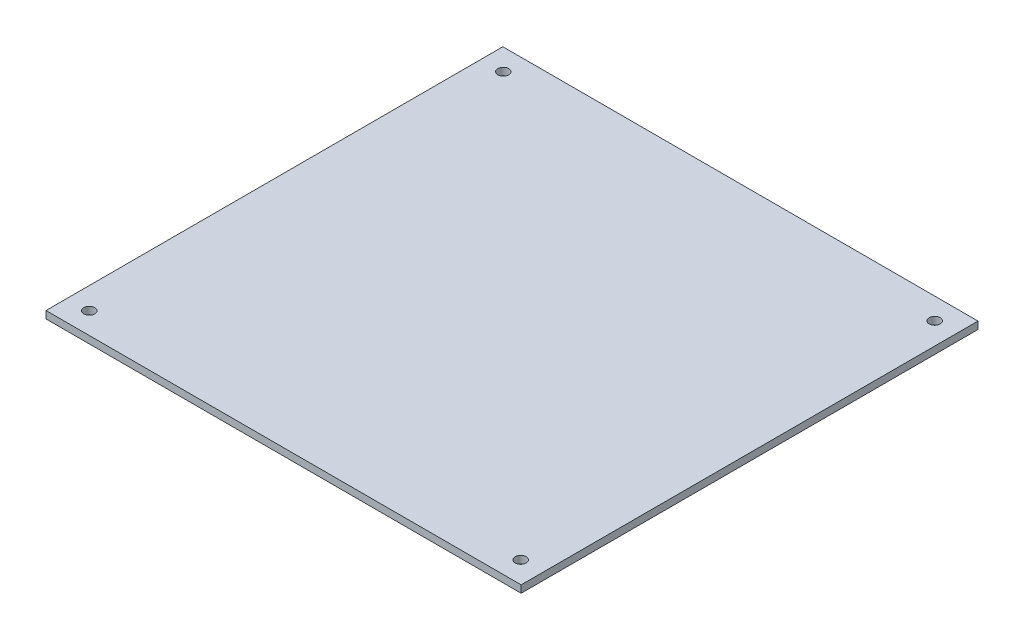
ISO-10303-21;
HEADER;
FILE_DESCRIPTION(('STEP AP214'),'2;1');
FILE_NAME('part.step','',(''),(''),'','','');
FILE_SCHEMA(('AUTOMOTIVE_DESIGN { 1 0 10303 214 1 1 1 1 }'));
ENDSEC;
DATA;
#1=APPLICATION_CONTEXT('core data for automotive mechanical design processes');
#2=APPLICATION_PROTOCOL_DEFINITION('international standard','automotive_design',2000,#1);
#3=PRODUCT_CONTEXT('',#1,'mechanical');
#4=PRODUCT('Part','Part','',(#3));
#5=PRODUCT_RELATED_PRODUCT_CATEGORY('part','',(#4));
#6=PRODUCT_DEFINITION_FORMATION('','',#4);
#7=PRODUCT_DEFINITION_CONTEXT('part definition',#1,'design');
#8=PRODUCT_DEFINITION('design','',#6,#7);
#9=PRODUCT_DEFINITION_SHAPE('','',#8);
#10=(LENGTH_UNIT() NAMED_UNIT(*) SI_UNIT(.MILLI.,.METRE.));
#11=(NAMED_UNIT(*) PLANE_ANGLE_UNIT() SI_UNIT($,.RADIAN.));
#12=(NAMED_UNIT(*) SI_UNIT($,.STERADIAN.) SOLID_ANGLE_UNIT());
#13=UNCERTAINTY_MEASURE_WITH_UNIT(LENGTH_MEASURE(1.E-05),#10,'distance_accuracy_value','');
#14=(GEOMETRIC_REPRESENTATION_CONTEXT(3) GLOBAL_UNCERTAINTY_ASSIGNED_CONTEXT((#13)) GLOBAL_UNIT_ASSIGNED_CONTEXT((#10,
#11,#12)) REPRESENTATION_CONTEXT('',''));
#15=CARTESIAN_POINT('',(0.,0.,0.));
#16=DIRECTION('',(0.,0.,1.));
#17=DIRECTION('',(1.,0.,0.));
#18=AXIS2_PLACEMENT_3D('',#15,#16,#17);
#19=CARTESIAN_POINT('',(0.,2.,0.));
#20=DIRECTION('',(0.,1.,0.));
#21=DIRECTION('',(0.,0.,1.));
#22=AXIS2_PLACEMENT_3D('',#19,#20,#21);
#23=PLANE('',#22);
#24=CARTESIAN_POINT('',(60.0235415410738,2.,-56.5120662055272));
#25=DIRECTION('',(0.,1.,0.));
#26=DIRECTION('',(0.,0.,1.));
#27=AXIS2_PLACEMENT_3D('',#24,#25,#26);
#28=CIRCLE('',#27,1.5);
#29=CARTESIAN_POINT('',(60.0235415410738,2.,-55.0120662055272));
#30=VERTEX_POINT('',#29);
#31=EDGE_CURVE('E121',#30,#30,#28,.T.);
#32=ORIENTED_EDGE('',*,*,#31,.F.);
#33=EDGE_LOOP('',(#32));
#34=FACE_BOUND('',#33,.T.);
#35=CARTESIAN_POINT('',(-58.0150782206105,2.,56.7631241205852));
#36=DIRECTION('',(0.,1.,0.));
#37=DIRECTION('',(0.,0.,1.));
#38=AXIS2_PLACEMENT_3D('',#35,#36,#37);
#39=CIRCLE('',#38,1.5);
#40=CARTESIAN_POINT('',(-58.0150782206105,2.,58.2631241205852));
#41=VERTEX_POINT('',#40);
#42=EDGE_CURVE('E100',#41,#41,#39,.T.);
#43=ORIENTED_EDGE('',*,*,#42,.F.);
#44=EDGE_LOOP('',(#43));
#45=FACE_BOUND('',#44,.T.);
#46=DIRECTION('',(1.,0.,0.));
#47=VECTOR('',#46,1.);
#48=CARTESIAN_POINT('',(-63.9957683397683,2.,62.625528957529));
#49=LINE('',#48,#47);
#50=CARTESIAN_POINT('',(-63.9957683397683,2.,62.625528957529));
#51=VERTEX_POINT('',#50);
#52=CARTESIAN_POINT('',(66.0042316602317,2.,62.625528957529));
#53=VERTEX_POINT('',#52);
#54=EDGE_CURVE('E85',#51,#53,#49,.T.);
#55=ORIENTED_EDGE('',*,*,#54,.T.);
#56=DIRECTION('',(0.,0.,-1.));
#57=VECTOR('',#56,1.);
#58=CARTESIAN_POINT('',(66.0042316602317,2.,62.625528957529));
#59=LINE('',#58,#57);
#60=CARTESIAN_POINT('',(66.0042316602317,2.,-62.374471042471));
#61=VERTEX_POINT('',#60);
#62=EDGE_CURVE('E80',#53,#61,#59,.T.);
#63=ORIENTED_EDGE('',*,*,#62,.T.);
#64=DIRECTION('',(-1.,0.,0.));
#65=VECTOR('',#64,1.);
#66=CARTESIAN_POINT('',(66.0042316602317,2.,-62.374471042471));
#67=LINE('',#66,#65);
#68=CARTESIAN_POINT('',(-63.9957683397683,2.,-62.374471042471));
#69=VERTEX_POINT('',#68);
#70=EDGE_CURVE('E83',#61,#69,#67,.T.);
#71=ORIENTED_EDGE('',*,*,#70,.T.);
#72=DIRECTION('',(0.,0.,1.));
#73=VECTOR('',#72,1.);
#74=CARTESIAN_POINT('',(-63.9957683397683,2.,-62.374471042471));
#75=LINE('',#74,#73);
#76=EDGE_CURVE('E50',#69,#51,#75,.T.);
#77=ORIENTED_EDGE('',*,*,#76,.T.);
#78=EDGE_LOOP('',(#55,#63,#71,#77));
#79=FACE_BOUND('',#78,.T.);
#80=CARTESIAN_POINT('',(60.0235415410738,2.,56.7631241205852));
#81=DIRECTION('',(0.,1.,0.));
#82=DIRECTION('',(0.,0.,1.));
#83=AXIS2_PLACEMENT_3D('',#80,#81,#82);
#84=CIRCLE('',#83,1.5);
#85=CARTESIAN_POINT('',(60.0235415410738,2.,58.2631241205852));
#86=VERTEX_POINT('',#85);
#87=EDGE_CURVE('E115',#86,#86,#84,.T.);
#88=ORIENTED_EDGE('',*,*,#87,.F.);
#89=EDGE_LOOP('',(#88));
#90=FACE_BOUND('',#89,.T.);
#91=CARTESIAN_POINT('',(-58.0150782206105,2.,-56.5120662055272));
#92=DIRECTION('',(0.,1.,0.));
#93=DIRECTION('',(0.,0.,1.));
#94=AXIS2_PLACEMENT_3D('',#91,#92,#93);
#95=CIRCLE('',#94,1.5);
#96=CARTESIAN_POINT('',(-58.0150782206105,2.,-55.0120662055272));
#97=VERTEX_POINT('',#96);
#98=EDGE_CURVE('E127',#97,#97,#95,.T.);
#99=ORIENTED_EDGE('',*,*,#98,.F.);
#100=EDGE_LOOP('',(#99));
#101=FACE_BOUND('',#100,.T.);
#102=ADVANCED_FACE('F33',(#34,#45,#79,#90,#101),#23,.T.);
#103=CARTESIAN_POINT('',(0.,0.,0.));
#104=DIRECTION('',(0.,1.,0.));
#105=DIRECTION('',(0.,0.,1.));
#106=AXIS2_PLACEMENT_3D('',#103,#104,#105);
#107=PLANE('',#106);
#108=DIRECTION('',(1.,0.,0.));
#109=VECTOR('',#108,1.);
#110=CARTESIAN_POINT('',(-63.9957683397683,0.,62.625528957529));
#111=LINE('',#110,#109);
#112=CARTESIAN_POINT('',(-63.9957683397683,0.,62.625528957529));
#113=VERTEX_POINT('',#112);
#114=CARTESIAN_POINT('',(66.0042316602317,0.,62.625528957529));
#115=VERTEX_POINT('',#114);
#116=EDGE_CURVE('E97',#113,#115,#111,.T.);
#117=ORIENTED_EDGE('',*,*,#116,.F.);
#118=DIRECTION('',(0.,0.,1.));
#119=VECTOR('',#118,1.);
#120=CARTESIAN_POINT('',(-63.9957683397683,0.,-62.374471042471));
#121=LINE('',#120,#119);
#122=CARTESIAN_POINT('',(-63.9957683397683,0.,-62.374471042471));
#123=VERTEX_POINT('',#122);
#124=EDGE_CURVE('E73',#123,#113,#121,.T.);
#125=ORIENTED_EDGE('',*,*,#124,.F.);
#126=DIRECTION('',(-1.,0.,0.));
#127=VECTOR('',#126,1.);
#128=CARTESIAN_POINT('',(66.0042316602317,0.,-62.374471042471));
#129=LINE('',#128,#127);
#130=CARTESIAN_POINT('',(66.0042316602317,0.,-62.374471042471));
#131=VERTEX_POINT('',#130);
#132=EDGE_CURVE('E67',#131,#123,#129,.T.);
#133=ORIENTED_EDGE('',*,*,#132,.F.);
#134=DIRECTION('',(0.,0.,-1.));
#135=VECTOR('',#134,1.);
#136=CARTESIAN_POINT('',(66.0042316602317,0.,62.625528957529));
#137=LINE('',#136,#135);
#138=EDGE_CURVE('E89',#115,#131,#137,.T.);
#139=ORIENTED_EDGE('',*,*,#138,.F.);
#140=EDGE_LOOP('',(#117,#125,#133,#139));
#141=FACE_BOUND('',#140,.T.);
#142=CARTESIAN_POINT('',(-58.0150782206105,0.,56.7631241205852));
#143=DIRECTION('',(0.,1.,0.));
#144=DIRECTION('',(0.,0.,1.));
#145=AXIS2_PLACEMENT_3D('',#142,#143,#144);
#146=CIRCLE('',#145,1.5);
#147=CARTESIAN_POINT('',(-58.0150782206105,0.,58.2631241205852));
#148=VERTEX_POINT('',#147);
#149=EDGE_CURVE('E112',#148,#148,#146,.T.);
#150=ORIENTED_EDGE('',*,*,#149,.T.);
#151=EDGE_LOOP('',(#150));
#152=FACE_BOUND('',#151,.T.);
#153=CARTESIAN_POINT('',(60.0235415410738,0.,56.7631241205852));
#154=DIRECTION('',(0.,1.,0.));
#155=DIRECTION('',(0.,0.,1.));
#156=AXIS2_PLACEMENT_3D('',#153,#154,#155);
#157=CIRCLE('',#156,1.5);
#158=CARTESIAN_POINT('',(60.0235415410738,0.,58.2631241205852));
#159=VERTEX_POINT('',#158);
#160=EDGE_CURVE('E118',#159,#159,#157,.T.);
#161=ORIENTED_EDGE('',*,*,#160,.T.);
#162=EDGE_LOOP('',(#161));
#163=FACE_BOUND('',#162,.T.);
#164=CARTESIAN_POINT('',(60.0235415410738,0.,-56.5120662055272));
#165=DIRECTION('',(0.,1.,0.));
#166=DIRECTION('',(0.,0.,1.));
#167=AXIS2_PLACEMENT_3D('',#164,#165,#166);
#168=CIRCLE('',#167,1.5);
#169=CARTESIAN_POINT('',(60.0235415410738,0.,-55.0120662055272));
#170=VERTEX_POINT('',#169);
#171=EDGE_CURVE('E124',#170,#170,#168,.T.);
#172=ORIENTED_EDGE('',*,*,#171,.T.);
#173=EDGE_LOOP('',(#172));
#174=FACE_BOUND('',#173,.T.);
#175=CARTESIAN_POINT('',(-58.0150782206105,0.,-56.5120662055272));
#176=DIRECTION('',(0.,1.,0.));
#177=DIRECTION('',(0.,0.,1.));
#178=AXIS2_PLACEMENT_3D('',#175,#176,#177);
#179=CIRCLE('',#178,1.5);
#180=CARTESIAN_POINT('',(-58.0150782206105,0.,-55.0120662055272));
#181=VERTEX_POINT('',#180);
#182=EDGE_CURVE('E130',#181,#181,#179,.T.);
#183=ORIENTED_EDGE('',*,*,#182,.T.);
#184=EDGE_LOOP('',(#183));
#185=FACE_BOUND('',#184,.T.);
#186=ADVANCED_FACE('F108',(#141,#152,#163,#174,#185),#107,.F.);
#187=CARTESIAN_POINT('',(-63.9957683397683,2.,62.625528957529));
#188=DIRECTION('',(0.,0.,-1.));
#189=DIRECTION('',(-1.,0.,0.));
#190=AXIS2_PLACEMENT_3D('',#187,#188,#189);
#191=PLANE('',#190);
#192=ORIENTED_EDGE('',*,*,#116,.T.);
#193=DIRECTION('',(0.,-1.,0.));
#194=VECTOR('',#193,1.);
#195=CARTESIAN_POINT('',(66.0042316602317,2.,62.625528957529));
#196=LINE('',#195,#194);
#197=EDGE_CURVE('E11',#53,#115,#196,.T.);
#198=ORIENTED_EDGE('',*,*,#197,.F.);
#199=ORIENTED_EDGE('',*,*,#54,.F.);
#200=DIRECTION('',(0.,-1.,0.));
#201=VECTOR('',#200,1.);
#202=CARTESIAN_POINT('',(-63.9957683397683,2.,62.625528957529));
#203=LINE('',#202,#201);
#204=EDGE_CURVE('E93',#51,#113,#203,.T.);
#205=ORIENTED_EDGE('',*,*,#204,.T.);
#206=EDGE_LOOP('',(#192,#198,#199,#205));
#207=FACE_BOUND('',#206,.T.);
#208=ADVANCED_FACE('F35',(#207),#191,.F.);
#209=CARTESIAN_POINT('',(66.0042316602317,2.,62.625528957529));
#210=DIRECTION('',(-1.,0.,0.));
#211=DIRECTION('',(0.,0.,1.));
#212=AXIS2_PLACEMENT_3D('',#209,#210,#211);
#213=PLANE('',#212);
#214=ORIENTED_EDGE('',*,*,#138,.T.);
#215=DIRECTION('',(0.,-1.,0.));
#216=VECTOR('',#215,1.);
#217=CARTESIAN_POINT('',(66.0042316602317,2.,-62.374471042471));
#218=LINE('',#217,#216);
#219=EDGE_CURVE('E42',#61,#131,#218,.T.);
#220=ORIENTED_EDGE('',*,*,#219,.F.);
#221=ORIENTED_EDGE('',*,*,#62,.F.);
#222=ORIENTED_EDGE('',*,*,#197,.T.);
#223=EDGE_LOOP('',(#214,#220,#221,#222));
#224=FACE_BOUND('',#223,.T.);
#225=ADVANCED_FACE('F88',(#224),#213,.F.);
#226=CARTESIAN_POINT('',(66.0042316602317,2.,-62.374471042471));
#227=DIRECTION('',(0.,0.,1.));
#228=DIRECTION('',(1.,0.,0.));
#229=AXIS2_PLACEMENT_3D('',#226,#227,#228);
#230=PLANE('',#229);
#231=ORIENTED_EDGE('',*,*,#132,.T.);
#232=DIRECTION('',(0.,-1.,0.));
#233=VECTOR('',#232,1.);
#234=CARTESIAN_POINT('',(-63.9957683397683,2.,-62.374471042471));
#235=LINE('',#234,#233);
#236=EDGE_CURVE('E90',#69,#123,#235,.T.);
#237=ORIENTED_EDGE('',*,*,#236,.F.);
#238=ORIENTED_EDGE('',*,*,#70,.F.);
#239=ORIENTED_EDGE('',*,*,#219,.T.);
#240=EDGE_LOOP('',(#231,#237,#238,#239));
#241=FACE_BOUND('',#240,.T.);
#242=ADVANCED_FACE('F91',(#241),#230,.F.);
#243=CARTESIAN_POINT('',(-63.9957683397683,2.,-62.374471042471));
#244=DIRECTION('',(1.,0.,0.));
#245=DIRECTION('',(0.,0.,-1.));
#246=AXIS2_PLACEMENT_3D('',#243,#244,#245);
#247=PLANE('',#246);
#248=ORIENTED_EDGE('',*,*,#124,.T.);
#249=ORIENTED_EDGE('',*,*,#204,.F.);
#250=ORIENTED_EDGE('',*,*,#76,.F.);
#251=ORIENTED_EDGE('',*,*,#236,.T.);
#252=EDGE_LOOP('',(#248,#249,#250,#251));
#253=FACE_BOUND('',#252,.T.);
#254=ADVANCED_FACE('F105',(#253),#247,.F.);
#255=CARTESIAN_POINT('',(-58.0150782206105,2.,56.7631241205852));
#256=DIRECTION('',(0.,-1.,0.));
#257=DIRECTION('',(0.,0.,-1.));
#258=AXIS2_PLACEMENT_3D('',#255,#256,#257);
#259=CYLINDRICAL_SURFACE('',#258,1.5);
#260=ORIENTED_EDGE('',*,*,#42,.T.);
#261=EDGE_LOOP('',(#260));
#262=FACE_BOUND('',#261,.T.);
#263=ORIENTED_EDGE('',*,*,#149,.F.);
#264=EDGE_LOOP('',(#263));
#265=FACE_BOUND('',#264,.T.);
#266=ADVANCED_FACE('F149',(#262,#265),#259,.F.);
#267=CARTESIAN_POINT('',(60.0235415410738,2.,56.7631241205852));
#268=DIRECTION('',(0.,-1.,0.));
#269=DIRECTION('',(0.,0.,-1.));
#270=AXIS2_PLACEMENT_3D('',#267,#268,#269);
#271=CYLINDRICAL_SURFACE('',#270,1.5);
#272=ORIENTED_EDGE('',*,*,#87,.T.);
#273=EDGE_LOOP('',(#272));
#274=FACE_BOUND('',#273,.T.);
#275=ORIENTED_EDGE('',*,*,#160,.F.);
#276=EDGE_LOOP('',(#275));
#277=FACE_BOUND('',#276,.T.);
#278=ADVANCED_FACE('F195',(#274,#277),#271,.F.);
#279=CARTESIAN_POINT('',(60.0235415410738,2.,-56.5120662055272));
#280=DIRECTION('',(0.,-1.,0.));
#281=DIRECTION('',(0.,0.,-1.));
#282=AXIS2_PLACEMENT_3D('',#279,#280,#281);
#283=CYLINDRICAL_SURFACE('',#282,1.5);
#284=ORIENTED_EDGE('',*,*,#31,.T.);
#285=EDGE_LOOP('',(#284));
#286=FACE_BOUND('',#285,.T.);
#287=ORIENTED_EDGE('',*,*,#171,.F.);
#288=EDGE_LOOP('',(#287));
#289=FACE_BOUND('',#288,.T.);
#290=ADVANCED_FACE('F203',(#286,#289),#283,.F.);
#291=CARTESIAN_POINT('',(-58.0150782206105,2.,-56.5120662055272));
#292=DIRECTION('',(0.,-1.,0.));
#293=DIRECTION('',(0.,0.,-1.));
#294=AXIS2_PLACEMENT_3D('',#291,#292,#293);
#295=CYLINDRICAL_SURFACE('',#294,1.5);
#296=ORIENTED_EDGE('',*,*,#98,.T.);
#297=EDGE_LOOP('',(#296));
#298=FACE_BOUND('',#297,.T.);
#299=ORIENTED_EDGE('',*,*,#182,.F.);
#300=EDGE_LOOP('',(#299));
#301=FACE_BOUND('',#300,.T.);
#302=ADVANCED_FACE('F136',(#298,#301),#295,.F.);
#303=CLOSED_SHELL('',(#102,#186,#208,#225,#242,#254,#266,#278,#290,#302));
#304=MANIFOLD_SOLID_BREP('B2',#303);
#305=ADVANCED_BREP_SHAPE_REPRESENTATION('',(#18,#304),#14);
#306=SHAPE_DEFINITION_REPRESENTATION(#9,#305);
ENDSEC;
END-ISO-10303-21;
